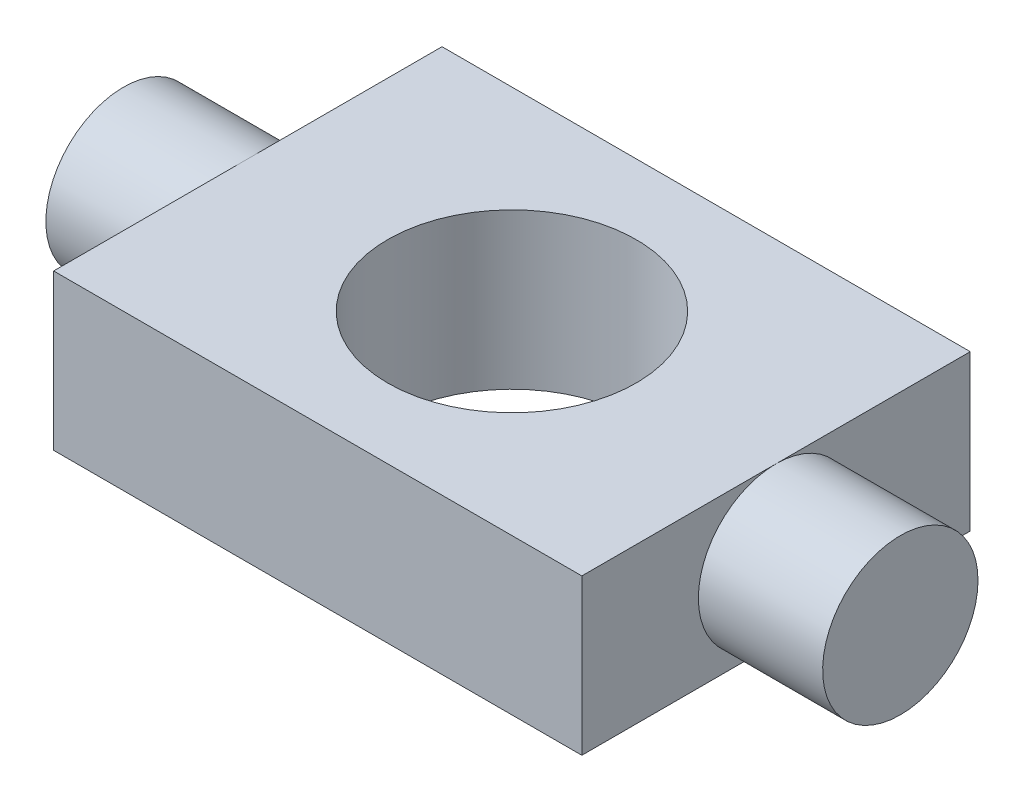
from build123d import *

# Parameters (mm, degrees)
ESQUISSE1_W             = 34
ESQUISSE1_H             = 10
BASE_EXTRUSION_DEPTH    = 25
ESQUISSE2_R             = 8
ENL_V_MAT_EXTRU_1_DEPTH = 44.370496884
ESQUISSE3_R             = 5
BOSS_EXTRU_1_DEPTH      = 8


with BuildPart() as part:
    # Esquisse1 → Base-Extrusion (new body)
    with BuildSketch(Plane.XY):
        with Locations((17, 5)):
            Rectangle(ESQUISSE1_W, ESQUISSE1_H)
    extrude(amount=BASE_EXTRUSION_DEPTH)

    # Esquisse2 → Enl_v. mat.-Extru.1 (cut, through all)
    with BuildSketch(Plane(origin=(0, 10, 0), x_dir=(-1, 0, 0), z_dir=(0, 1, 0))):
        with Locations(Location((-17, 12.5, 0), (0, 0, 90))):
            Circle(ESQUISSE2_R)
    extrude(amount=-ENL_V_MAT_EXTRU_1_DEPTH, mode=Mode.SUBTRACT)

    # Esquisse3 → Boss.-Extru.1 (add)
    with BuildSketch(Plane(origin=(34, 0, 0), x_dir=(0, 0, -1), z_dir=(1, 0, 0))):
        with Locations(Location((-12.5, 5, 0), (0, 0, 270))):
            Circle(ESQUISSE3_R)
    boss_extru_1 = extrude(amount=BOSS_EXTRU_1_DEPTH)

    # Sym_trie1: Boss.-Extru.1 across plane
    add(boss_extru_1.mirror(Plane(origin=(17, 0, 0), x_dir=(0, 0, 1), z_dir=(1, 0, 0))))


solid = part.part
